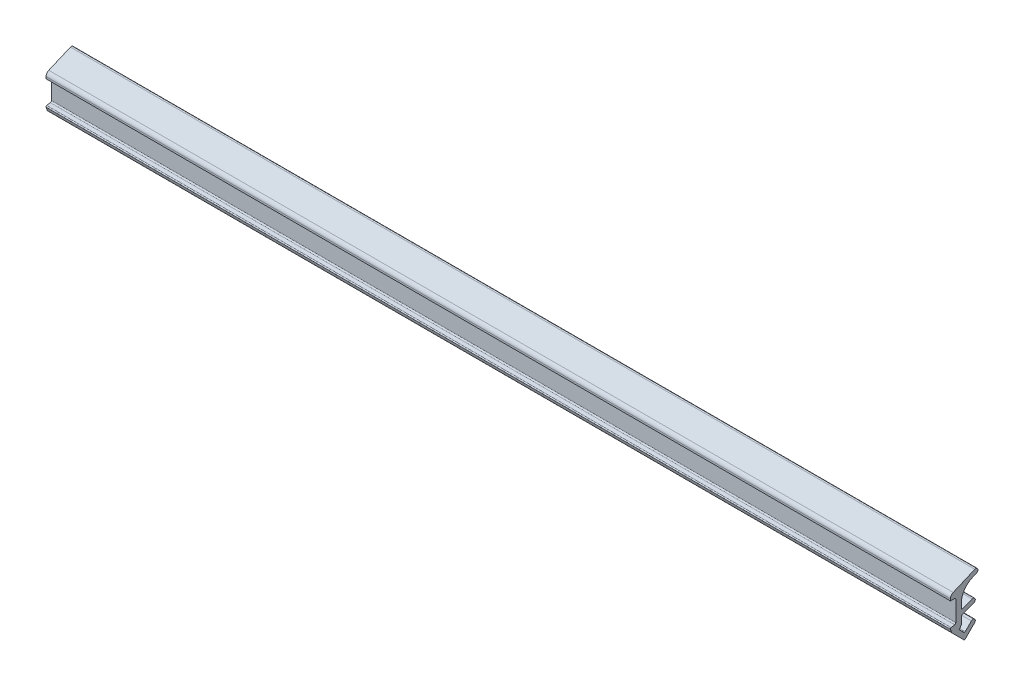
from build123d import *

# Parameters (mm, degrees)
PANEELITIIVISTEET_1_6021_PANEELITIIVISTE_DEPTH = 200


with BuildPart() as part:
    # Sketch1 → Paneelitiivisteet 1.6021 PANEELITIIVISTE (new body)
    with BuildSketch(Plane(origin=(0, 0, 0), x_dir=(0, 0, -1), z_dir=(1, 0, 0))):
        with BuildLine():
            Line((2.812477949, 5.656202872), (3.772958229, 6.064502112))
            ThreePointArc((3.772958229, 6.064502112), (4.03749836, 6.720260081), (3.381740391, 6.984800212))
            Line((3.381740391, 6.984800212), (-1.413868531, 4.946191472))
            ThreePointArc((-1.413868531, 4.946191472), (-1.856682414, 4.577609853), (-2.022650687, 4.02589337))
            Line((-2.022650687, 4.02589337), (-2.022650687, 3.62465119))
            Line((-2.022650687, 3.62465119), (-1.122650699, 3.62465119))
            ThreePointArc((-1.122650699, 3.62465119), (-0.910518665, 3.536783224), (-0.822650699, 3.32465119))
            Line((-0.822650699, 3.32465119), (-0.822650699, -1.12361892))
            ThreePointArc((-0.822650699, -1.12361892), (-0.892837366, -1.316455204), (-1.070556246, -1.419061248))
            Line((-1.070556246, -1.419061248), (-1.857380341, -1.557799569))
            ThreePointArc((-1.857380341, -1.557799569), (-1.995855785, -1.654761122), (-2.010589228, -1.823165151))
            Line((-2.010589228, -1.823165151), (-1.726566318, -2.60351169))
            ThreePointArc((-1.726566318, -2.60351169), (-1.707306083, -2.642567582), (-1.680049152, -2.676529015))
            Line((-1.680049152, -2.676529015), (0.960192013, -5.31677018))
            ThreePointArc((0.960192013, -5.31677018), (1.101613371, -5.375348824), (1.243034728, -5.31677018))
            Line((1.243034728, -5.31677018), (3.330902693, -3.228902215))
            ThreePointArc((3.330902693, -3.228902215), (3.330902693, -2.521795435), (2.623795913, -2.521795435))
            Line((2.623795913, -2.521795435), (1.243034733, -3.902556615))
            ThreePointArc((1.243034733, -3.902556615), (1.101613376, -3.961135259), (0.960192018, -3.902556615))
            Line((0.960192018, -3.902556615), (0.050623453, -2.99298805))
            ThreePointArc((0.050623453, -2.99298805), (-0.006244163, -2.87767193), (0.018839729, -2.75156669))
            Line((0.018839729, -2.75156669), (0.450554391, -2.003814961))
            ThreePointArc((0.450554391, -2.003814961), (0.470534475, -1.95557877), (0.47734931, -1.903814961))
            Line((0.47734931, -1.903814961), (0.47734931, -0.457404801))
            ThreePointArc((0.47734931, -0.457404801), (0.513518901, -0.342689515), (0.608945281, -0.269466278))
            Line((0.608945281, -0.269466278), (3.148359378, 0.65480486))
            ThreePointArc((3.148359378, 0.65480486), (3.447195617, 1.295661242), (2.806339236, 1.59449748))
            Line((2.806339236, 1.59449748), (0.645753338, 0.80810852))
            ThreePointArc((0.645753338, 0.80810852), (0.462634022, 0.832216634), (0.377349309, 0.996047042))
            Line((0.377349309, 0.996047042), (0.377349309, 1.975010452))
            ThreePointArc((0.377349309, 1.975010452), (1.041222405, 4.181876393), (2.812477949, 5.656202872))
        make_face()
    extrude(amount=PANEELITIIVISTEET_1_6021_PANEELITIIVISTE_DEPTH)


solid = part.part
